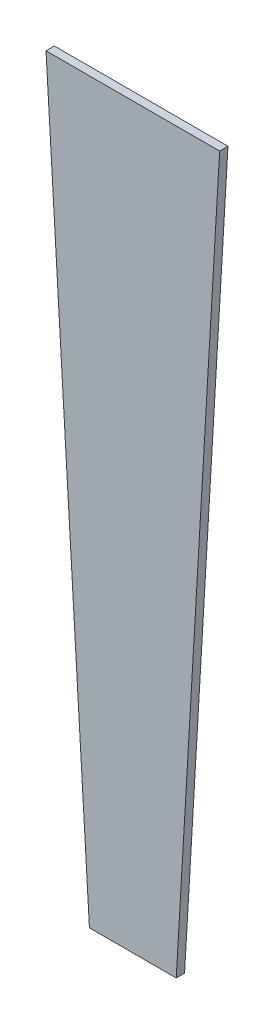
ISO-10303-21;
HEADER;
FILE_DESCRIPTION(('STEP AP214'),'2;1');
FILE_NAME('part.step','',(''),(''),'','','');
FILE_SCHEMA(('AUTOMOTIVE_DESIGN { 1 0 10303 214 1 1 1 1 }'));
ENDSEC;
DATA;
#1=APPLICATION_CONTEXT('core data for automotive mechanical design processes');
#2=APPLICATION_PROTOCOL_DEFINITION('international standard','automotive_design',2000,#1);
#3=PRODUCT_CONTEXT('',#1,'mechanical');
#4=PRODUCT('Part','Part','',(#3));
#5=PRODUCT_RELATED_PRODUCT_CATEGORY('part','',(#4));
#6=PRODUCT_DEFINITION_FORMATION('','',#4);
#7=PRODUCT_DEFINITION_CONTEXT('part definition',#1,'design');
#8=PRODUCT_DEFINITION('design','',#6,#7);
#9=PRODUCT_DEFINITION_SHAPE('','',#8);
#10=(LENGTH_UNIT() NAMED_UNIT(*) SI_UNIT(.MILLI.,.METRE.));
#11=(NAMED_UNIT(*) PLANE_ANGLE_UNIT() SI_UNIT($,.RADIAN.));
#12=(NAMED_UNIT(*) SI_UNIT($,.STERADIAN.) SOLID_ANGLE_UNIT());
#13=UNCERTAINTY_MEASURE_WITH_UNIT(LENGTH_MEASURE(1.E-05),#10,'distance_accuracy_value','');
#14=(GEOMETRIC_REPRESENTATION_CONTEXT(3) GLOBAL_UNCERTAINTY_ASSIGNED_CONTEXT((#13)) GLOBAL_UNIT_ASSIGNED_CONTEXT((#10,
#11,#12)) REPRESENTATION_CONTEXT('',''));
#15=CARTESIAN_POINT('',(0.,0.,0.));
#16=DIRECTION('',(0.,0.,1.));
#17=DIRECTION('',(1.,0.,0.));
#18=AXIS2_PLACEMENT_3D('',#15,#16,#17);
#19=CARTESIAN_POINT('',(-6.35,-107.95,-1.2192));
#20=DIRECTION('',(0.998274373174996,-0.0587220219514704,0.));
#21=DIRECTION('',(0.0587220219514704,0.998274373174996,0.));
#22=AXIS2_PLACEMENT_3D('',#19,#20,#21);
#23=PLANE('',#22);
#24=DIRECTION('',(0.0587220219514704,0.998274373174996,0.));
#25=VECTOR('',#24,1.);
#26=CARTESIAN_POINT('',(-6.35,-107.95,0.));
#27=LINE('',#26,#25);
#28=CARTESIAN_POINT('',(-6.35,-107.95,0.));
#29=VERTEX_POINT('',#28);
#30=CARTESIAN_POINT('',(0.,0.,0.));
#31=VERTEX_POINT('',#30);
#32=EDGE_CURVE('E104',#29,#31,#27,.T.);
#33=ORIENTED_EDGE('',*,*,#32,.F.);
#34=DIRECTION('',(0.,0.,1.));
#35=VECTOR('',#34,1.);
#36=CARTESIAN_POINT('',(-6.35,-107.95,-1.2192));
#37=LINE('',#36,#35);
#38=CARTESIAN_POINT('',(-6.35,-107.95,-1.2192));
#39=VERTEX_POINT('',#38);
#40=EDGE_CURVE('E11',#39,#29,#37,.T.);
#41=ORIENTED_EDGE('',*,*,#40,.F.);
#42=DIRECTION('',(0.0587220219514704,0.998274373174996,0.));
#43=VECTOR('',#42,1.);
#44=CARTESIAN_POINT('',(-6.35,-107.95,-1.2192));
#45=LINE('',#44,#43);
#46=CARTESIAN_POINT('',(0.,0.,-1.2192));
#47=VERTEX_POINT('',#46);
#48=EDGE_CURVE('E98',#39,#47,#45,.T.);
#49=ORIENTED_EDGE('',*,*,#48,.T.);
#50=DIRECTION('',(0.,0.,1.));
#51=VECTOR('',#50,1.);
#52=CARTESIAN_POINT('',(0.,0.,-1.2192));
#53=LINE('',#52,#51);
#54=EDGE_CURVE('E43',#47,#31,#53,.T.);
#55=ORIENTED_EDGE('',*,*,#54,.T.);
#56=EDGE_LOOP('',(#33,#41,#49,#55));
#57=FACE_BOUND('',#56,.T.);
#58=ADVANCED_FACE('F40',(#57),#23,.T.);
#59=CARTESIAN_POINT('',(-19.05,-107.95,-1.2192));
#60=DIRECTION('',(0.,-1.,0.));
#61=DIRECTION('',(0.,0.,-1.));
#62=AXIS2_PLACEMENT_3D('',#59,#60,#61);
#63=PLANE('',#62);
#64=DIRECTION('',(1.,0.,0.));
#65=VECTOR('',#64,1.);
#66=CARTESIAN_POINT('',(-19.05,-107.95,0.));
#67=LINE('',#66,#65);
#68=CARTESIAN_POINT('',(-19.05,-107.95,0.));
#69=VERTEX_POINT('',#68);
#70=EDGE_CURVE('E100',#69,#29,#67,.T.);
#71=ORIENTED_EDGE('',*,*,#70,.F.);
#72=DIRECTION('',(0.,0.,1.));
#73=VECTOR('',#72,1.);
#74=CARTESIAN_POINT('',(-19.05,-107.95,-1.2192));
#75=LINE('',#74,#73);
#76=CARTESIAN_POINT('',(-19.05,-107.95,-1.2192));
#77=VERTEX_POINT('',#76);
#78=EDGE_CURVE('E49',#77,#69,#75,.T.);
#79=ORIENTED_EDGE('',*,*,#78,.F.);
#80=DIRECTION('',(1.,0.,0.));
#81=VECTOR('',#80,1.);
#82=CARTESIAN_POINT('',(-19.05,-107.95,-1.2192));
#83=LINE('',#82,#81);
#84=EDGE_CURVE('E95',#77,#39,#83,.T.);
#85=ORIENTED_EDGE('',*,*,#84,.T.);
#86=ORIENTED_EDGE('',*,*,#40,.T.);
#87=EDGE_LOOP('',(#71,#79,#85,#86));
#88=FACE_BOUND('',#87,.T.);
#89=ADVANCED_FACE('F114',(#88),#63,.T.);
#90=CARTESIAN_POINT('',(-25.4,0.,-1.2192));
#91=DIRECTION('',(-0.998274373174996,-0.0587220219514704,0.));
#92=DIRECTION('',(0.0587220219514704,-0.998274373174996,0.));
#93=AXIS2_PLACEMENT_3D('',#90,#91,#92);
#94=PLANE('',#93);
#95=DIRECTION('',(0.0587220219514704,-0.998274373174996,0.));
#96=VECTOR('',#95,1.);
#97=CARTESIAN_POINT('',(-25.4,0.,0.));
#98=LINE('',#97,#96);
#99=CARTESIAN_POINT('',(-25.4,0.,0.));
#100=VERTEX_POINT('',#99);
#101=EDGE_CURVE('E90',#100,#69,#98,.T.);
#102=ORIENTED_EDGE('',*,*,#101,.F.);
#103=DIRECTION('',(0.,0.,1.));
#104=VECTOR('',#103,1.);
#105=CARTESIAN_POINT('',(-25.4,0.,-1.2192));
#106=LINE('',#105,#104);
#107=CARTESIAN_POINT('',(-25.4,0.,-1.2192));
#108=VERTEX_POINT('',#107);
#109=EDGE_CURVE('E85',#108,#100,#106,.T.);
#110=ORIENTED_EDGE('',*,*,#109,.F.);
#111=DIRECTION('',(0.0587220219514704,-0.998274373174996,0.));
#112=VECTOR('',#111,1.);
#113=CARTESIAN_POINT('',(-25.4,0.,-1.2192));
#114=LINE('',#113,#112);
#115=EDGE_CURVE('E88',#108,#77,#114,.T.);
#116=ORIENTED_EDGE('',*,*,#115,.T.);
#117=ORIENTED_EDGE('',*,*,#78,.T.);
#118=EDGE_LOOP('',(#102,#110,#116,#117));
#119=FACE_BOUND('',#118,.T.);
#120=ADVANCED_FACE('F87',(#119),#94,.T.);
#121=CARTESIAN_POINT('',(0.,0.,-1.2192));
#122=DIRECTION('',(0.,1.,0.));
#123=DIRECTION('',(0.,0.,1.));
#124=AXIS2_PLACEMENT_3D('',#121,#122,#123);
#125=PLANE('',#124);
#126=DIRECTION('',(-1.,0.,0.));
#127=VECTOR('',#126,1.);
#128=CARTESIAN_POINT('',(0.,0.,0.));
#129=LINE('',#128,#127);
#130=EDGE_CURVE('E107',#31,#100,#129,.T.);
#131=ORIENTED_EDGE('',*,*,#130,.F.);
#132=ORIENTED_EDGE('',*,*,#54,.F.);
#133=DIRECTION('',(-1.,0.,0.));
#134=VECTOR('',#133,1.);
#135=CARTESIAN_POINT('',(0.,0.,-1.2192));
#136=LINE('',#135,#134);
#137=EDGE_CURVE('E94',#47,#108,#136,.T.);
#138=ORIENTED_EDGE('',*,*,#137,.T.);
#139=ORIENTED_EDGE('',*,*,#109,.T.);
#140=EDGE_LOOP('',(#131,#132,#138,#139));
#141=FACE_BOUND('',#140,.T.);
#142=ADVANCED_FACE('F97',(#141),#125,.T.);
#143=CARTESIAN_POINT('',(0.,0.,-1.2192));
#144=DIRECTION('',(0.,0.,1.));
#145=DIRECTION('',(1.,0.,0.));
#146=AXIS2_PLACEMENT_3D('',#143,#144,#145);
#147=PLANE('',#146);
#148=ORIENTED_EDGE('',*,*,#48,.F.);
#149=ORIENTED_EDGE('',*,*,#84,.F.);
#150=ORIENTED_EDGE('',*,*,#115,.F.);
#151=ORIENTED_EDGE('',*,*,#137,.F.);
#152=EDGE_LOOP('',(#148,#149,#150,#151));
#153=FACE_BOUND('',#152,.T.);
#154=ADVANCED_FACE('F93',(#153),#147,.F.);
#155=CARTESIAN_POINT('',(0.,0.,0.));
#156=DIRECTION('',(0.,0.,1.));
#157=DIRECTION('',(1.,0.,0.));
#158=AXIS2_PLACEMENT_3D('',#155,#156,#157);
#159=PLANE('',#158);
#160=ORIENTED_EDGE('',*,*,#32,.T.);
#161=ORIENTED_EDGE('',*,*,#130,.T.);
#162=ORIENTED_EDGE('',*,*,#101,.T.);
#163=ORIENTED_EDGE('',*,*,#70,.T.);
#164=EDGE_LOOP('',(#160,#161,#162,#163));
#165=FACE_BOUND('',#164,.T.);
#166=ADVANCED_FACE('F113',(#165),#159,.T.);
#167=CLOSED_SHELL('',(#58,#89,#120,#142,#154,#166));
#168=MANIFOLD_SOLID_BREP('B2',#167);
#169=ADVANCED_BREP_SHAPE_REPRESENTATION('',(#18,#168),#14);
#170=SHAPE_DEFINITION_REPRESENTATION(#9,#169);
ENDSEC;
END-ISO-10303-21;
